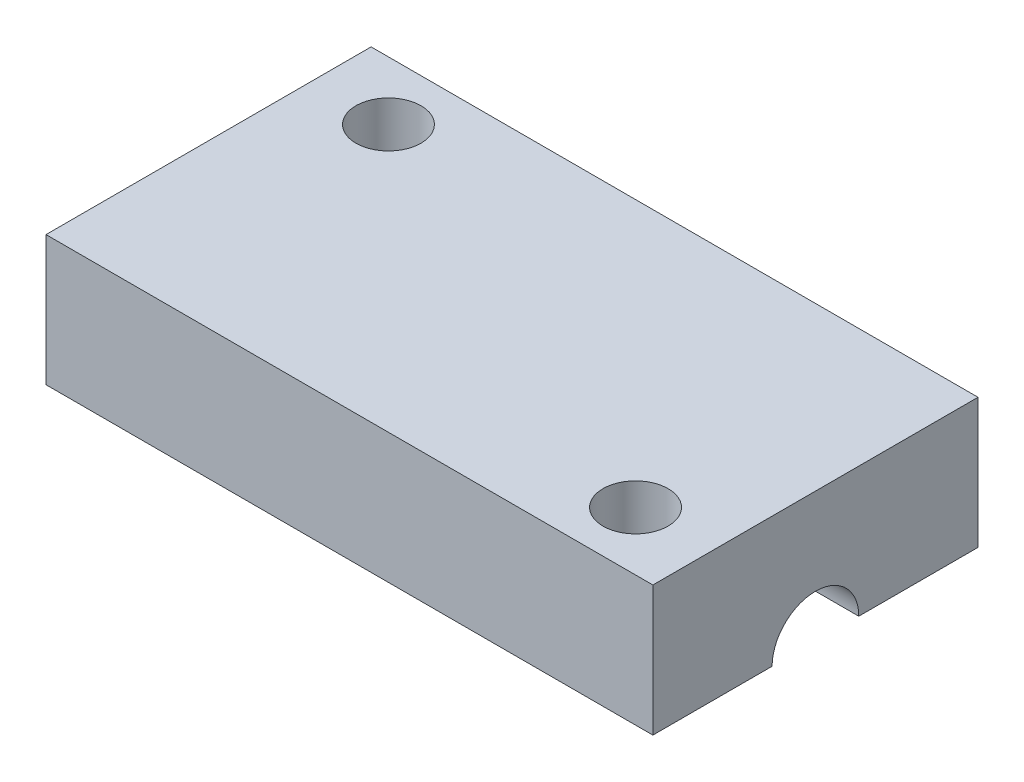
from build123d import *

# Parameters (mm, degrees)
BOSS_EXTRU_1_DEPTH      = 14
ESQUISSE2_R             = 1.5
ENL_V_MAT_EXTRU_1_DEPTH = 17.977926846


with BuildPart() as part:
    # Esquisse1 → Boss.-Extru.1 (new, symmetric)
    with BuildSketch(Plane(origin=(0, 0, 0), x_dir=(0, 0, -1), z_dir=(1, 0, 0))):
        with BuildLine():
            Line((-7.5, 0), (-2, 0))
            ThreePointArc((-2, 0), (0, 2), (2, 0))
            Line((2, 0), (7.5, 0))
            Line((7.5, 0), (7.5, 6))
            Line((7.5, 6), (-7.5, 6))
            Line((-7.5, 6), (-7.5, 0))
        make_face()
    extrude(amount=BOSS_EXTRU_1_DEPTH, both=True)

    # Esquisse2 → Enl_v. mat.-Extru.1 (cut, through all)
    with BuildSketch(Plane(origin=(0, 6, 0), x_dir=(1, 0, 0), z_dir=(0, 1, 0))):
        with Locations(Location((-10.5, 4.8, 0), (0, 0, 270))):
            Circle(ESQUISSE2_R)
        with Locations(Location((10.5, -4.8, 0), (0, 0, 270))):
            Circle(ESQUISSE2_R)
    extrude(amount=-ENL_V_MAT_EXTRU_1_DEPTH, mode=Mode.SUBTRACT)


solid = part.part
